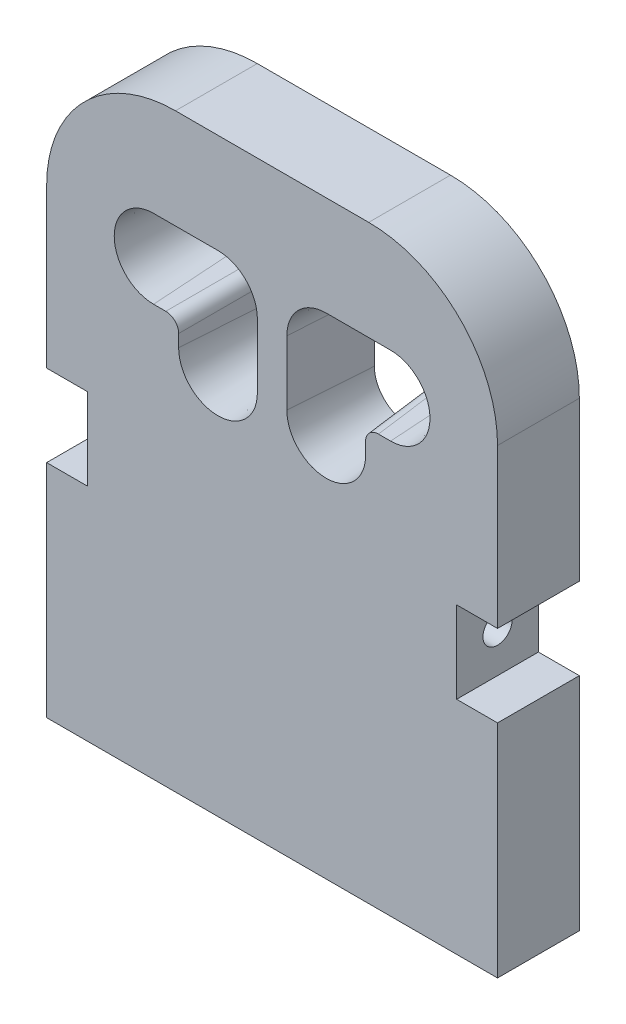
from build123d import *

# Parameters (mm, degrees)
SKETCH1_W                     = 35
SKETCH1_H                     = 45.8
BOSS_EXTRUDE1_DEPTH           = 6.35
FILLET3_R                     = 10
SKETCH10_W                    = 6.35
SKETCH10_H                    = 6.35
CUT_EXTRUDE5_DEPTH            = 3.175
SKETCH11_W                    = 6.35
SKETCH11_H                    = 6.35
CUT_EXTRUDE6_DEPTH            = 3.175
CUT_EXTRUDE7_DEPTH            = 30.512412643
CUT_EXTRUDE7_DRAFT            = 4
CUT_EXTRUDE7_PROFILE_2_DEPTH  = 30.512412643
CUT_EXTRUDE7_PROFILE_2_DRAFT  = 4
FILLET5_R                     = 1
MIRROR5_COPY_1_DEPTH          = 30.512412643
MIRROR5_COPY_1_DRAFT          = 4
MIRROR5_COPY_2_DEPTH          = 30.512412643
MIRROR5_COPY_2_DRAFT          = 4
MIRROR5_COPY_3_DEPTH          = 30.512412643
MIRROR5_COPY_3_DRAFT          = 4
FILLET5_OF_MIRROR5_R          = 1
TAP_DRILL_FOR_4_40_TAP3_D     = 2.2606
TAP_DRILL_FOR_4_40_TAP3_DEPTH = 3.9688
TAP_DRILL_FOR_4_40_TAP3_TIP   = 0.679152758


with BuildPart() as part:
    # Sketch1 → Boss-Extrude1 (new body)
    with BuildSketch(Plane.XY):
        Rectangle(SKETCH1_W, SKETCH1_H)
    extrude(amount=BOSS_EXTRUDE1_DEPTH)

    # Fillet3
    fillet3_edges = [part.edges().sort_by_distance(p)[0] for p in [
        (-17.5, 22.9, 3.175),
        (17.5, 22.9, 3.175),
    ]]
    fillet(fillet3_edges, radius=FILLET3_R)

    # Sketch10 → Cut-Extrude5 (cut)
    with BuildSketch(Plane.ZY.offset(17.5)):
        with Locations((3.175, -2.575)):
            Rectangle(SKETCH10_W, SKETCH10_H)
    extrude(amount=-CUT_EXTRUDE5_DEPTH, mode=Mode.SUBTRACT)

    # Sketch11 → Cut-Extrude6 (cut)
    with BuildSketch(Plane(origin=(17.5, 0, 0), x_dir=(0, 0, -1), z_dir=(1, 0, 0))):
        with Locations((-3.175, -2.575)):
            Rectangle(SKETCH11_W, SKETCH11_H)
    extrude(amount=-CUT_EXTRUDE6_DEPTH, mode=Mode.SUBTRACT)

    # Sketch15 → Tap Drill for _4-40 Tap2 (revolve, cut)
    with BuildSketch(Plane(origin=(-14.325, -2.575, 3.175), x_dir=(0, 0, 1), z_dir=(0, 1, 0))):
        Polygon((0, 0), (0, 7.029152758), (1.1303, 6.35), (1.1303, 0), align=None)
    tap_drill_for_4_40_tap2 = revolve(axis=Axis((-20.675, -2.575, 3.175), (1, 0, 0)), mode=Mode.SUBTRACT)

    # Mirror1: Tap Drill for _4-40 Tap2 across plane
    add(tap_drill_for_4_40_tap2.mirror(Plane(origin=(0, 0, 0), x_dir=(0, 0, 1), z_dir=(1, 0, 0))), mode=Mode.SUBTRACT)

    # Sketch17 → 1_8 _0.1250_ Dowel Hole1 (revolve, cut)
    with BuildSketch(Plane(origin=(-5.5, -22.9, 3.175), x_dir=(0, 0, -1), z_dir=(1, 0, 0))):
        Polygon((0, 0), (0, 7.303866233), (1.5875, 6.35), (1.5875, 0), align=None)
    f_1_8_0_1250_dowel_hole1 = revolve(axis=Axis((-5.5, -29.25, 3.175), (0, 1, 0)), mode=Mode.SUBTRACT)

    # Sketch19 → Tap Drill for _4-40 Tap1 (revolve, cut)
    with BuildSketch(Plane(origin=(-11.5, -22.9, 3.175), x_dir=(0, 0, -1), z_dir=(1, 0, 0))):
        Polygon((0, 0), (0, 13.379152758), (1.1303, 12.7), (1.1303, 0), align=None)
    tap_drill_for_4_40_tap1 = revolve(axis=Axis((-11.5, -29.25, 3.175), (0, 1, 0)), mode=Mode.SUBTRACT)

    # Mirror2: Tap Drill for _4-40 Tap1 across plane
    add(tap_drill_for_4_40_tap1.mirror(Plane(origin=(0, 0, 0), x_dir=(0, 0, 1), z_dir=(1, 0, 0))), mode=Mode.SUBTRACT)

    # Mirror3: 1_8 _0.1250_ Dowel Hole1 across plane
    add(f_1_8_0_1250_dowel_hole1.mirror(Plane(origin=(0, 0, 0), x_dir=(0, 0, 1), z_dir=(1, 0, 0))), mode=Mode.SUBTRACT)


with BuildPart() as cut_extrude7_tool:
    # Sketch21 → Cut-Extrude7 (with draft: the straight prism first)
    with BuildSketch(Plane(origin=(0, 0, 0), x_dir=(-1, 0, 0), z_dir=(0, 0, -1))):
        with BuildLine():
            ThreePointArc((4.2, 14.710993), (1.589007, 12.1), (4.2, 9.489007))
            Line((4.2, 9.489007), (9.2, 9.489007))
            ThreePointArc((9.2, 9.489007), (11.810993, 12.1), (9.2, 14.710993))
            Line((9.2, 14.710993), (4.2, 14.710993))
        make_face()
    extrude(amount=-CUT_EXTRUDE7_DEPTH)
    # Cut-Extrude7: the draft: its side faces are tilted about the plane it starts from
    cut_extrude7_sides = [cut_extrude7_tool.faces().sort_by_distance(p)[0] for p in [
        (-1.589007, 12.1, 15.256206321),
        (-6.7, 9.489007, 15.256206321),
        (-11.810993, 12.1, 15.256206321),
        (-6.7, 14.710993, 15.256206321),
    ]]
    draft(cut_extrude7_sides, Plane(origin=(0, 0, 0), x_dir=(-1, 0, 0), z_dir=(0, 0, -1)), CUT_EXTRUDE7_DRAFT)


with BuildPart() as part_1:
    add(part.part)

    # Cut-Extrude7: cut by cut_extrude7_tool
    add(cut_extrude7_tool.part, mode=Mode.SUBTRACT)


with BuildPart() as cut_extrude7_profile_2_tool:
    # Sketch21 → Cut-Extrude7 profile 2 (with draft: the straight prism first)
    with BuildSketch(Plane(origin=(0, 0, 0), x_dir=(-1, 0, 0), z_dir=(0, 0, -1))):
        with BuildLine():
            ThreePointArc((1.589007, 7.1), (4.2, 4.489007), (6.810993, 7.1))
            Line((6.810993, 7.1), (6.810993, 12.1))
            ThreePointArc((6.810993, 12.1), (4.2, 14.710993), (1.589007, 12.1))
            Line((1.589007, 12.1), (1.589007, 7.1))
        make_face()
    extrude(amount=-CUT_EXTRUDE7_PROFILE_2_DEPTH)
    # Cut-Extrude7 profile 2: the draft: its side faces are tilted about the plane it starts from
    cut_extrude7_profile_2_sides = [cut_extrude7_profile_2_tool.faces().sort_by_distance(p)[0] for p in [
        (-4.2, 14.710993, 15.256206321),
        (-1.589007, 9.6, 15.256206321),
        (-4.2, 4.489007, 15.256206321),
        (-6.810993, 9.6, 15.256206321),
    ]]
    draft(cut_extrude7_profile_2_sides, Plane(origin=(0, 0, 0), x_dir=(-1, 0, 0), z_dir=(0, 0, -1)), CUT_EXTRUDE7_PROFILE_2_DRAFT)


with BuildPart() as part_2:
    add(part_1.part)

    # Cut-Extrude7 profile 2: cut by cut_extrude7_profile_2_tool
    add(cut_extrude7_profile_2_tool.part, mode=Mode.SUBTRACT)

    # Fillet5
    fillet5_edges = [part_2.edges().sort_by_distance(p)[0] for p in [
        (-7.033010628, 9.266989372, 3.175),
    ]]
    fillet(fillet5_edges, radius=FILLET5_R)


with BuildPart() as mirror5_copy_1_tool:
    # Mirror5 copy 1 sketch → Mirror5 copy 1 (with draft: the straight prism first)
    with BuildSketch(Plane(origin=(0, 0, 0), x_dir=(1, 0, 0), z_dir=(0, 0, -1))):
        with BuildLine():
            ThreePointArc((4.2, -14.710993), (1.589007, -12.1), (4.2, -9.489007))
            Line((4.2, -9.489007), (9.2, -9.489007))
            ThreePointArc((9.2, -9.489007), (11.810993, -12.1), (9.2, -14.710993))
            Line((9.2, -14.710993), (4.2, -14.710993))
        make_face()
    extrude(amount=-MIRROR5_COPY_1_DEPTH)
    # Mirror5 copy 1: the draft: its side faces are tilted about the plane it starts from
    mirror5_copy_1_sides = [mirror5_copy_1_tool.faces().sort_by_distance(p)[0] for p in [
        (1.589007, 12.1, 15.256206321),
        (6.7, 9.489007, 15.256206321),
        (11.810993, 12.1, 15.256206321),
        (6.7, 14.710993, 15.256206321),
    ]]
    draft(mirror5_copy_1_sides, Plane(origin=(0, 0, 0), x_dir=(1, 0, 0), z_dir=(0, 0, -1)), MIRROR5_COPY_1_DRAFT)


with BuildPart() as part_3:
    add(part_2.part)

    # Mirror5 copy 1: cut by mirror5_copy_1_tool
    add(mirror5_copy_1_tool.part, mode=Mode.SUBTRACT)


with BuildPart() as mirror5_copy_2_tool:
    # Mirror5 copy 2 sketch → Mirror5 copy 2 (with draft: the straight prism first)
    with BuildSketch(Plane(origin=(0, 0, 0), x_dir=(1, 0, 0), z_dir=(0, 0, -1))):
        with BuildLine():
            ThreePointArc((1.589007, -7.1), (4.2, -4.489007), (6.810993, -7.1))
            Line((6.810993, -7.1), (6.810993, -12.1))
            ThreePointArc((6.810993, -12.1), (4.2, -14.710993), (1.589007, -12.1))
            Line((1.589007, -12.1), (1.589007, -7.1))
        make_face()
    extrude(amount=-MIRROR5_COPY_2_DEPTH)
    # Mirror5 copy 2: the draft: its side faces are tilted about the plane it starts from
    mirror5_copy_2_sides = [mirror5_copy_2_tool.faces().sort_by_distance(p)[0] for p in [
        (4.2, 14.710993, 15.256206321),
        (1.589007, 9.6, 15.256206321),
        (4.2, 4.489007, 15.256206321),
        (6.810993, 9.6, 15.256206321),
    ]]
    draft(mirror5_copy_2_sides, Plane(origin=(0, 0, 0), x_dir=(1, 0, 0), z_dir=(0, 0, -1)), MIRROR5_COPY_2_DRAFT)


with BuildPart() as part_4:
    add(part_3.part)

    # Mirror5 copy 2: cut by mirror5_copy_2_tool
    add(mirror5_copy_2_tool.part, mode=Mode.SUBTRACT)


with BuildPart() as mirror5_copy_3_tool:
    # Mirror5 copy 3 sketch → Mirror5 copy 3 (with draft: the straight prism first)
    with BuildSketch(Plane(origin=(0, 0, 0), x_dir=(1, 0, 0), z_dir=(0, 0, -1))):
        with BuildLine():
            ThreePointArc((1.589007, -7.1), (4.2, -4.489007), (6.810993, -7.1))
            Line((6.810993, -7.1), (6.810993, -12.1))
            ThreePointArc((6.810993, -12.1), (4.2, -14.710993), (1.589007, -12.1))
            Line((1.589007, -12.1), (1.589007, -7.1))
        make_face()
    extrude(amount=-MIRROR5_COPY_3_DEPTH)
    # Mirror5 copy 3: the draft: its side faces are tilted about the plane it starts from
    mirror5_copy_3_sides = [mirror5_copy_3_tool.faces().sort_by_distance(p)[0] for p in [
        (4.2, 14.710993, 15.256206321),
        (1.589007, 9.6, 15.256206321),
        (4.2, 4.489007, 15.256206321),
        (6.810993, 9.6, 15.256206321),
    ]]
    draft(mirror5_copy_3_sides, Plane(origin=(0, 0, 0), x_dir=(1, 0, 0), z_dir=(0, 0, -1)), MIRROR5_COPY_3_DRAFT)


with BuildPart() as part_5:
    add(part_4.part)

    # Mirror5 copy 3: cut by mirror5_copy_3_tool
    add(mirror5_copy_3_tool.part, mode=Mode.SUBTRACT)

    # Fillet5 of Mirror5
    fillet5_of_mirror5_edges = [part_5.edges().sort_by_distance(p)[0] for p in [
        (7.033010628, 9.266989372, 3.175),
    ]]
    fillet(fillet5_of_mirror5_edges, radius=FILLET5_OF_MIRROR5_R)

    # Tap Drill for _4-40 Tap3
    with Locations(Plane(origin=(0, 0, 0), x_dir=(-1, 0, 0), z_dir=(0, 0, -1))):
        with Locations((0, 2.1)):
            Hole(TAP_DRILL_FOR_4_40_TAP3_D / 2, depth=TAP_DRILL_FOR_4_40_TAP3_DEPTH)
            with Locations((0, 0, -(TAP_DRILL_FOR_4_40_TAP3_DEPTH + TAP_DRILL_FOR_4_40_TAP3_TIP / 2))):  # 118° drill point
                Cone(0, TAP_DRILL_FOR_4_40_TAP3_D / 2, TAP_DRILL_FOR_4_40_TAP3_TIP, mode=Mode.SUBTRACT)


solid = part_5.part
